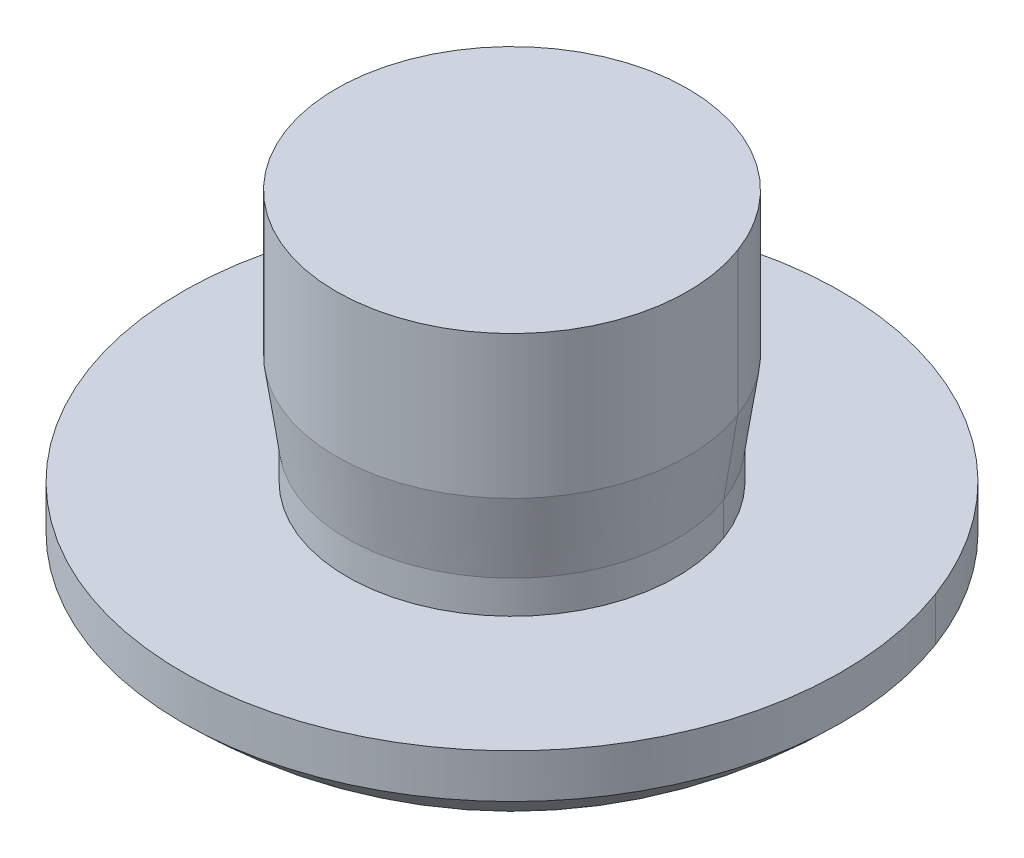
ISO-10303-21;
HEADER;
FILE_DESCRIPTION(('STEP AP214'),'2;1');
FILE_NAME('part.step','',(''),(''),'','','');
FILE_SCHEMA(('AUTOMOTIVE_DESIGN { 1 0 10303 214 1 1 1 1 }'));
ENDSEC;
DATA;
#1=APPLICATION_CONTEXT('core data for automotive mechanical design processes');
#2=APPLICATION_PROTOCOL_DEFINITION('international standard','automotive_design',2000,#1);
#3=PRODUCT_CONTEXT('',#1,'mechanical');
#4=PRODUCT('Part','Part','',(#3));
#5=PRODUCT_RELATED_PRODUCT_CATEGORY('part','',(#4));
#6=PRODUCT_DEFINITION_FORMATION('','',#4);
#7=PRODUCT_DEFINITION_CONTEXT('part definition',#1,'design');
#8=PRODUCT_DEFINITION('design','',#6,#7);
#9=PRODUCT_DEFINITION_SHAPE('','',#8);
#10=(LENGTH_UNIT() NAMED_UNIT(*) SI_UNIT(.MILLI.,.METRE.));
#11=(NAMED_UNIT(*) PLANE_ANGLE_UNIT() SI_UNIT($,.RADIAN.));
#12=(NAMED_UNIT(*) SI_UNIT($,.STERADIAN.) SOLID_ANGLE_UNIT());
#13=UNCERTAINTY_MEASURE_WITH_UNIT(LENGTH_MEASURE(1.E-05),#10,'distance_accuracy_value','');
#14=(GEOMETRIC_REPRESENTATION_CONTEXT(3) GLOBAL_UNCERTAINTY_ASSIGNED_CONTEXT((#13)) GLOBAL_UNIT_ASSIGNED_CONTEXT((#10,
#11,#12)) REPRESENTATION_CONTEXT('',''));
#15=CARTESIAN_POINT('',(0.,0.,0.));
#16=DIRECTION('',(0.,0.,1.));
#17=DIRECTION('',(1.,0.,0.));
#18=AXIS2_PLACEMENT_3D('',#15,#16,#17);
#19=CARTESIAN_POINT('',(17.3911017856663,16.2984233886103,17.2699844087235));
#20=DIRECTION('',(-0.937923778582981,0.,0.34684144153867));
#21=DIRECTION('',(0.34684144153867,0.,0.937923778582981));
#22=AXIS2_PLACEMENT_3D('',#19,#20,#21);
#23=SPHERICAL_SURFACE('',#22,4.22940321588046);
#24=CARTESIAN_POINT('',(17.3911017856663,16.2984233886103,17.2699844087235));
#25=DIRECTION('',(-0.937923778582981,0.,0.34684144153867));
#26=DIRECTION('',(-0.34684144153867,0.,-0.937923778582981));
#27=AXIS2_PLACEMENT_3D('',#24,#25,#26);
#28=CIRCLE('',#27,4.22940321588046);
#29=CARTESIAN_POINT('',(16.3505774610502,13.3171733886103,14.4562130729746));
#30=VERTEX_POINT('',#29);
#31=CARTESIAN_POINT('',(16.6107085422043,12.7171733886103,15.1596559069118));
#32=VERTEX_POINT('',#31);
#33=EDGE_CURVE('E190',#30,#32,#28,.T.);
#34=ORIENTED_EDGE('',*,*,#33,.F.);
#35=CARTESIAN_POINT('',(17.3911017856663,13.3171733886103,17.2699844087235));
#36=DIRECTION('',(0.,-1.,0.));
#37=DIRECTION('',(-0.937923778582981,0.,0.346841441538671));
#38=AXIS2_PLACEMENT_3D('',#35,#36,#37);
#39=CIRCLE('',#38,3.);
#40=CARTESIAN_POINT('',(20.2048731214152,13.3171733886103,16.2294600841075));
#41=VERTEX_POINT('',#40);
#42=EDGE_CURVE('E146',#30,#41,#39,.T.);
#43=ORIENTED_EDGE('',*,*,#42,.T.);
#44=CARTESIAN_POINT('',(17.3911017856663,13.3171733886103,17.2699844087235));
#45=DIRECTION('',(0.,-1.,0.));
#46=DIRECTION('',(-0.937923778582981,0.,0.346841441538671));
#47=AXIS2_PLACEMENT_3D('',#44,#45,#46);
#48=CIRCLE('',#47,3.);
#49=CARTESIAN_POINT('',(18.4316261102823,13.3171733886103,20.0837557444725));
#50=VERTEX_POINT('',#49);
#51=EDGE_CURVE('E37',#41,#50,#48,.T.);
#52=ORIENTED_EDGE('',*,*,#51,.T.);
#53=CARTESIAN_POINT('',(17.3911017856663,16.2984233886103,17.2699844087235));
#54=DIRECTION('',(0.937923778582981,0.,-0.34684144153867));
#55=DIRECTION('',(0.34684144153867,0.,0.937923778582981));
#56=AXIS2_PLACEMENT_3D('',#53,#54,#55);
#57=CIRCLE('',#56,4.22940321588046);
#58=CARTESIAN_POINT('',(18.1714950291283,12.7171733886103,19.3803129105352));
#59=VERTEX_POINT('',#58);
#60=EDGE_CURVE('E127',#50,#59,#57,.T.);
#61=ORIENTED_EDGE('',*,*,#60,.T.);
#62=CARTESIAN_POINT('',(17.3911017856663,12.7171733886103,17.2699844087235));
#63=DIRECTION('',(0.,-1.,0.));
#64=DIRECTION('',(-0.937923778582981,0.,0.346841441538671));
#65=AXIS2_PLACEMENT_3D('',#62,#63,#64);
#66=CIRCLE('',#65,2.25);
#67=EDGE_CURVE('E11',#32,#59,#66,.T.);
#68=ORIENTED_EDGE('',*,*,#67,.F.);
#69=EDGE_LOOP('',(#34,#43,#52,#61,#68));
#70=FACE_BOUND('',#69,.T.);
#71=ADVANCED_FACE('F16',(#70),#23,.T.);
#72=CARTESIAN_POINT('',(17.3911017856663,12.7171733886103,17.2699844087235));
#73=DIRECTION('',(0.,-1.,0.));
#74=DIRECTION('',(0.937923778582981,0.,-0.34684144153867));
#75=AXIS2_PLACEMENT_3D('',#72,#73,#74);
#76=PLANE('',#75);
#77=CARTESIAN_POINT('',(17.3911017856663,12.7171733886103,17.2699844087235));
#78=DIRECTION('',(0.,-1.,0.));
#79=DIRECTION('',(-0.937923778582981,0.,0.346841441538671));
#80=AXIS2_PLACEMENT_3D('',#77,#78,#79);
#81=CIRCLE('',#80,2.25);
#82=EDGE_CURVE('E183',#59,#32,#81,.T.);
#83=ORIENTED_EDGE('',*,*,#82,.T.);
#84=ORIENTED_EDGE('',*,*,#67,.T.);
#85=EDGE_LOOP('',(#83,#84));
#86=FACE_BOUND('',#85,.T.);
#87=ADVANCED_FACE('F238',(#86),#76,.T.);
#88=CARTESIAN_POINT('',(17.9460480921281,16.0171733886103,18.7706624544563));
#89=DIRECTION('',(0.,1.,0.));
#90=DIRECTION('',(0.937923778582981,0.,-0.34684144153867));
#91=AXIS2_PLACEMENT_3D('',#88,#89,#90);
#92=PLANE('',#91);
#93=CARTESIAN_POINT('',(17.3911017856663,16.0171733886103,17.2699844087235));
#94=DIRECTION('',(0.,-1.,0.));
#95=DIRECTION('',(-0.937923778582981,0.,0.346841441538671));
#96=AXIS2_PLACEMENT_3D('',#93,#94,#95);
#97=CIRCLE('',#96,1.6);
#98=CARTESIAN_POINT('',(15.8904237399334,16.0171733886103,17.8249307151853));
#99=VERTEX_POINT('',#98);
#100=CARTESIAN_POINT('',(18.891779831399,16.0171733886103,16.7150381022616));
#101=VERTEX_POINT('',#100);
#102=EDGE_CURVE('E112',#99,#101,#97,.T.);
#103=ORIENTED_EDGE('',*,*,#102,.F.);
#104=CARTESIAN_POINT('',(17.3911017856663,16.0171733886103,17.2699844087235));
#105=DIRECTION('',(0.,-1.,0.));
#106=DIRECTION('',(-0.937923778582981,0.,0.346841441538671));
#107=AXIS2_PLACEMENT_3D('',#104,#105,#106);
#108=CIRCLE('',#107,1.6);
#109=EDGE_CURVE('E25',#101,#99,#108,.T.);
#110=ORIENTED_EDGE('',*,*,#109,.F.);
#111=EDGE_LOOP('',(#103,#110));
#112=FACE_BOUND('',#111,.T.);
#113=ADVANCED_FACE('F118',(#112),#92,.T.);
#114=CARTESIAN_POINT('',(17.3911017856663,6.31955303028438,17.2699844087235));
#115=DIRECTION('',(0.,-1.,0.));
#116=DIRECTION('',(-0.937923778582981,0.,0.346841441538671));
#117=AXIS2_PLACEMENT_3D('',#114,#115,#116);
#118=CYLINDRICAL_SURFACE('',#117,1.6);
#119=DIRECTION('',(0.,-1.,0.));
#120=VECTOR('',#119,1.);
#121=CARTESIAN_POINT('',(18.891779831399,6.31955303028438,16.7150381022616));
#122=LINE('',#121,#120);
#123=CARTESIAN_POINT('',(18.891779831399,14.7171733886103,16.7150381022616));
#124=VERTEX_POINT('',#123);
#125=EDGE_CURVE('E104',#101,#124,#122,.T.);
#126=ORIENTED_EDGE('',*,*,#125,.F.);
#127=ORIENTED_EDGE('',*,*,#109,.T.);
#128=DIRECTION('',(0.,-1.,0.));
#129=VECTOR('',#128,1.);
#130=CARTESIAN_POINT('',(15.8904237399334,6.31955303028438,17.8249307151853));
#131=LINE('',#130,#129);
#132=CARTESIAN_POINT('',(15.8904237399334,14.7171733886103,17.8249307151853));
#133=VERTEX_POINT('',#132);
#134=EDGE_CURVE('E101',#99,#133,#131,.T.);
#135=ORIENTED_EDGE('',*,*,#134,.T.);
#136=CARTESIAN_POINT('',(17.3911017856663,14.7171733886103,17.2699844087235));
#137=DIRECTION('',(0.,-1.,0.));
#138=DIRECTION('',(-0.937923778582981,0.,0.346841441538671));
#139=AXIS2_PLACEMENT_3D('',#136,#137,#138);
#140=CIRCLE('',#139,1.6);
#141=EDGE_CURVE('E109',#124,#133,#140,.T.);
#142=ORIENTED_EDGE('',*,*,#141,.F.);
#143=EDGE_LOOP('',(#126,#127,#135,#142));
#144=FACE_BOUND('',#143,.T.);
#145=ADVANCED_FACE('F100',(#144),#118,.T.);
#146=CARTESIAN_POINT('',(17.3911017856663,14.0171733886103,17.2699844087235));
#147=DIRECTION('',(0.,1.,0.));
#148=DIRECTION('',(0.937923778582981,0.,-0.346841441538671));
#149=AXIS2_PLACEMENT_3D('',#146,#147,#148);
#150=CONICAL_SURFACE('',#149,1.5,0.141897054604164);
#151=DIRECTION('',(-0.132642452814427,0.989949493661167,0.0490507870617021));
#152=VECTOR('',#151,1.);
#153=CARTESIAN_POINT('',(15.9842161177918,14.0171733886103,17.7902465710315));
#154=LINE('',#153,#152);
#155=CARTESIAN_POINT('',(15.9842161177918,14.0171733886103,17.7902465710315));
#156=VERTEX_POINT('',#155);
#157=EDGE_CURVE('E136',#156,#133,#154,.T.);
#158=ORIENTED_EDGE('',*,*,#157,.F.);
#159=CARTESIAN_POINT('',(17.3911017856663,14.0171733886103,17.2699844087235));
#160=DIRECTION('',(0.,-1.,0.));
#161=DIRECTION('',(-0.937923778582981,0.,0.346841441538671));
#162=AXIS2_PLACEMENT_3D('',#159,#160,#161);
#163=CIRCLE('',#162,1.5);
#164=CARTESIAN_POINT('',(18.7979874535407,14.0171733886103,16.7497222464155));
#165=VERTEX_POINT('',#164);
#166=EDGE_CURVE('E158',#165,#156,#163,.T.);
#167=ORIENTED_EDGE('',*,*,#166,.F.);
#168=DIRECTION('',(0.132642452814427,0.989949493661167,-0.0490507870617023));
#169=VECTOR('',#168,1.);
#170=CARTESIAN_POINT('',(18.7979874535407,14.0171733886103,16.7497222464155));
#171=LINE('',#170,#169);
#172=EDGE_CURVE('E170',#165,#124,#171,.T.);
#173=ORIENTED_EDGE('',*,*,#172,.T.);
#174=ORIENTED_EDGE('',*,*,#141,.T.);
#175=EDGE_LOOP('',(#158,#167,#173,#174));
#176=FACE_BOUND('',#175,.T.);
#177=ADVANCED_FACE('F167',(#176),#150,.T.);
#178=CARTESIAN_POINT('',(17.3911017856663,6.31955303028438,17.2699844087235));
#179=DIRECTION('',(0.,-1.,0.));
#180=DIRECTION('',(-0.937923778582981,0.,0.346841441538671));
#181=AXIS2_PLACEMENT_3D('',#178,#179,#180);
#182=CYLINDRICAL_SURFACE('',#181,1.5);
#183=DIRECTION('',(0.,-1.,0.));
#184=VECTOR('',#183,1.);
#185=CARTESIAN_POINT('',(18.7979874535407,6.31955303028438,16.7497222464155));
#186=LINE('',#185,#184);
#187=CARTESIAN_POINT('',(18.7979874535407,13.7171733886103,16.7497222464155));
#188=VERTEX_POINT('',#187);
#189=EDGE_CURVE('E179',#165,#188,#186,.T.);
#190=ORIENTED_EDGE('',*,*,#189,.F.);
#191=ORIENTED_EDGE('',*,*,#166,.T.);
#192=DIRECTION('',(0.,-1.,0.));
#193=VECTOR('',#192,1.);
#194=CARTESIAN_POINT('',(15.9842161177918,6.31955303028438,17.7902465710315));
#195=LINE('',#194,#193);
#196=CARTESIAN_POINT('',(15.9842161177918,13.7171733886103,17.7902465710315));
#197=VERTEX_POINT('',#196);
#198=EDGE_CURVE('E142',#156,#197,#195,.T.);
#199=ORIENTED_EDGE('',*,*,#198,.T.);
#200=CARTESIAN_POINT('',(17.3911017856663,13.7171733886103,17.2699844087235));
#201=DIRECTION('',(0.,-1.,0.));
#202=DIRECTION('',(-0.937923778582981,0.,0.346841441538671));
#203=AXIS2_PLACEMENT_3D('',#200,#201,#202);
#204=CIRCLE('',#203,1.5);
#205=EDGE_CURVE('E78',#188,#197,#204,.T.);
#206=ORIENTED_EDGE('',*,*,#205,.F.);
#207=EDGE_LOOP('',(#190,#191,#199,#206));
#208=FACE_BOUND('',#207,.T.);
#209=ADVANCED_FACE('F234',(#208),#182,.T.);
#210=CARTESIAN_POINT('',(17.9113639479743,13.7171733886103,18.676870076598));
#211=DIRECTION('',(0.,1.,0.));
#212=DIRECTION('',(0.937923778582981,0.,-0.34684144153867));
#213=AXIS2_PLACEMENT_3D('',#210,#211,#212);
#214=PLANE('',#213);
#215=CARTESIAN_POINT('',(17.3911017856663,13.7171733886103,17.2699844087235));
#216=DIRECTION('',(0.,-1.,0.));
#217=DIRECTION('',(-0.937923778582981,0.,0.346841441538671));
#218=AXIS2_PLACEMENT_3D('',#215,#216,#217);
#219=CIRCLE('',#218,1.5);
#220=EDGE_CURVE('E199',#197,#188,#219,.T.);
#221=ORIENTED_EDGE('',*,*,#220,.T.);
#222=ORIENTED_EDGE('',*,*,#205,.T.);
#223=EDGE_LOOP('',(#221,#222));
#224=FACE_BOUND('',#223,.T.);
#225=CARTESIAN_POINT('',(17.3911017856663,13.7171733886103,17.2699844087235));
#226=DIRECTION('',(0.,-1.,0.));
#227=DIRECTION('',(-0.937923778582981,0.,0.346841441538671));
#228=AXIS2_PLACEMENT_3D('',#225,#226,#227);
#229=CIRCLE('',#228,3.);
#230=CARTESIAN_POINT('',(14.5773304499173,13.7171733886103,18.3105087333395));
#231=VERTEX_POINT('',#230);
#232=CARTESIAN_POINT('',(20.2048731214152,13.7171733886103,16.2294600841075));
#233=VERTEX_POINT('',#232);
#234=EDGE_CURVE('E137',#231,#233,#229,.T.);
#235=ORIENTED_EDGE('',*,*,#234,.F.);
#236=CARTESIAN_POINT('',(17.3911017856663,13.7171733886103,17.2699844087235));
#237=DIRECTION('',(0.,-1.,0.));
#238=DIRECTION('',(-0.937923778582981,0.,0.346841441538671));
#239=AXIS2_PLACEMENT_3D('',#236,#237,#238);
#240=CIRCLE('',#239,3.);
#241=EDGE_CURVE('E66',#233,#231,#240,.T.);
#242=ORIENTED_EDGE('',*,*,#241,.F.);
#243=EDGE_LOOP('',(#235,#242));
#244=FACE_BOUND('',#243,.T.);
#245=ADVANCED_FACE('F225',(#224,#244),#214,.T.);
#246=CARTESIAN_POINT('',(17.3911017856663,6.31955303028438,17.2699844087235));
#247=DIRECTION('',(0.,-1.,0.));
#248=DIRECTION('',(-0.937923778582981,0.,0.346841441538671));
#249=AXIS2_PLACEMENT_3D('',#246,#247,#248);
#250=CYLINDRICAL_SURFACE('',#249,3.);
#251=DIRECTION('',(0.,-1.,0.));
#252=VECTOR('',#251,1.);
#253=CARTESIAN_POINT('',(20.2048731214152,6.31955303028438,16.2294600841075));
#254=LINE('',#253,#252);
#255=EDGE_CURVE('E141',#233,#41,#254,.T.);
#256=ORIENTED_EDGE('',*,*,#255,.F.);
#257=ORIENTED_EDGE('',*,*,#241,.T.);
#258=DIRECTION('',(0.,-1.,0.));
#259=VECTOR('',#258,1.);
#260=CARTESIAN_POINT('',(14.5773304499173,6.31955303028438,18.3105087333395));
#261=LINE('',#260,#259);
#262=CARTESIAN_POINT('',(14.5773304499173,13.3171733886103,18.3105087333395));
#263=VERTEX_POINT('',#262);
#264=EDGE_CURVE('E149',#231,#263,#261,.T.);
#265=ORIENTED_EDGE('',*,*,#264,.T.);
#266=CARTESIAN_POINT('',(17.3911017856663,13.3171733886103,17.2699844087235));
#267=DIRECTION('',(0.,-1.,0.));
#268=DIRECTION('',(-0.937923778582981,0.,0.346841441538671));
#269=AXIS2_PLACEMENT_3D('',#266,#267,#268);
#270=CIRCLE('',#269,3.);
#271=EDGE_CURVE('E120',#50,#263,#270,.T.);
#272=ORIENTED_EDGE('',*,*,#271,.F.);
#273=ORIENTED_EDGE('',*,*,#51,.F.);
#274=EDGE_LOOP('',(#256,#257,#265,#272,#273));
#275=FACE_BOUND('',#274,.T.);
#276=ADVANCED_FACE('F223',(#275),#250,.T.);
#277=CARTESIAN_POINT('',(17.3911017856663,6.31955303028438,17.2699844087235));
#278=DIRECTION('',(0.,-1.,0.));
#279=DIRECTION('',(-0.937923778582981,0.,0.346841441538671));
#280=AXIS2_PLACEMENT_3D('',#277,#278,#279);
#281=CYLINDRICAL_SURFACE('',#280,3.);
#282=ORIENTED_EDGE('',*,*,#234,.T.);
#283=ORIENTED_EDGE('',*,*,#255,.T.);
#284=ORIENTED_EDGE('',*,*,#42,.F.);
#285=CARTESIAN_POINT('',(17.3911017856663,13.3171733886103,17.2699844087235));
#286=DIRECTION('',(0.,-1.,0.));
#287=DIRECTION('',(-0.937923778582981,0.,0.346841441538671));
#288=AXIS2_PLACEMENT_3D('',#285,#286,#287);
#289=CIRCLE('',#288,3.);
#290=EDGE_CURVE('E196',#263,#30,#289,.T.);
#291=ORIENTED_EDGE('',*,*,#290,.F.);
#292=ORIENTED_EDGE('',*,*,#264,.F.);
#293=EDGE_LOOP('',(#282,#283,#284,#291,#292));
#294=FACE_BOUND('',#293,.T.);
#295=ADVANCED_FACE('F217',(#294),#281,.T.);
#296=CARTESIAN_POINT('',(17.3911017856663,6.31955303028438,17.2699844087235));
#297=DIRECTION('',(0.,-1.,0.));
#298=DIRECTION('',(-0.937923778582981,0.,0.346841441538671));
#299=AXIS2_PLACEMENT_3D('',#296,#297,#298);
#300=CYLINDRICAL_SURFACE('',#299,1.5);
#301=CARTESIAN_POINT('',(17.3911017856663,14.0171733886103,17.2699844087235));
#302=DIRECTION('',(0.,-1.,0.));
#303=DIRECTION('',(-0.937923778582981,0.,0.346841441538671));
#304=AXIS2_PLACEMENT_3D('',#301,#302,#303);
#305=CIRCLE('',#304,1.5);
#306=EDGE_CURVE('E116',#156,#165,#305,.T.);
#307=ORIENTED_EDGE('',*,*,#306,.T.);
#308=ORIENTED_EDGE('',*,*,#189,.T.);
#309=ORIENTED_EDGE('',*,*,#220,.F.);
#310=ORIENTED_EDGE('',*,*,#198,.F.);
#311=EDGE_LOOP('',(#307,#308,#309,#310));
#312=FACE_BOUND('',#311,.T.);
#313=ADVANCED_FACE('F232',(#312),#300,.T.);
#314=CARTESIAN_POINT('',(17.3911017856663,14.0171733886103,17.2699844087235));
#315=DIRECTION('',(0.,1.,0.));
#316=DIRECTION('',(0.937923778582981,0.,-0.346841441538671));
#317=AXIS2_PLACEMENT_3D('',#314,#315,#316);
#318=CONICAL_SURFACE('',#317,1.5,0.141897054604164);
#319=ORIENTED_EDGE('',*,*,#306,.F.);
#320=ORIENTED_EDGE('',*,*,#157,.T.);
#321=CARTESIAN_POINT('',(17.3911017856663,14.7171733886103,17.2699844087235));
#322=DIRECTION('',(0.,-1.,0.));
#323=DIRECTION('',(-0.937923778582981,0.,0.346841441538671));
#324=AXIS2_PLACEMENT_3D('',#321,#322,#323);
#325=CIRCLE('',#324,1.6);
#326=EDGE_CURVE('E114',#133,#124,#325,.T.);
#327=ORIENTED_EDGE('',*,*,#326,.T.);
#328=ORIENTED_EDGE('',*,*,#172,.F.);
#329=EDGE_LOOP('',(#319,#320,#327,#328));
#330=FACE_BOUND('',#329,.T.);
#331=ADVANCED_FACE('F172',(#330),#318,.T.);
#332=CARTESIAN_POINT('',(17.3911017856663,6.31955303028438,17.2699844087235));
#333=DIRECTION('',(0.,-1.,0.));
#334=DIRECTION('',(-0.937923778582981,0.,0.346841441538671));
#335=AXIS2_PLACEMENT_3D('',#332,#333,#334);
#336=CYLINDRICAL_SURFACE('',#335,1.6);
#337=ORIENTED_EDGE('',*,*,#102,.T.);
#338=ORIENTED_EDGE('',*,*,#125,.T.);
#339=ORIENTED_EDGE('',*,*,#326,.F.);
#340=ORIENTED_EDGE('',*,*,#134,.F.);
#341=EDGE_LOOP('',(#337,#338,#339,#340));
#342=FACE_BOUND('',#341,.T.);
#343=ADVANCED_FACE('F111',(#342),#336,.T.);
#344=CARTESIAN_POINT('',(17.3911017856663,16.2984233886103,17.2699844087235));
#345=DIRECTION('',(-0.937923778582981,0.,0.34684144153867));
#346=DIRECTION('',(0.34684144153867,0.,0.937923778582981));
#347=AXIS2_PLACEMENT_3D('',#344,#345,#346);
#348=SPHERICAL_SURFACE('',#347,4.22940321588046);
#349=ORIENTED_EDGE('',*,*,#290,.T.);
#350=ORIENTED_EDGE('',*,*,#33,.T.);
#351=ORIENTED_EDGE('',*,*,#82,.F.);
#352=ORIENTED_EDGE('',*,*,#60,.F.);
#353=ORIENTED_EDGE('',*,*,#271,.T.);
#354=EDGE_LOOP('',(#349,#350,#351,#352,#353));
#355=FACE_BOUND('',#354,.T.);
#356=ADVANCED_FACE('F210',(#355),#348,.T.);
#357=CLOSED_SHELL('',(#71,#87,#113,#145,#177,#209,#245,#276,#295,#313,#331,#343,#356));
#358=MANIFOLD_SOLID_BREP('B1',#357);
#359=ADVANCED_BREP_SHAPE_REPRESENTATION('',(#18,#358),#14);
#360=SHAPE_DEFINITION_REPRESENTATION(#9,#359);
ENDSEC;
END-ISO-10303-21;
